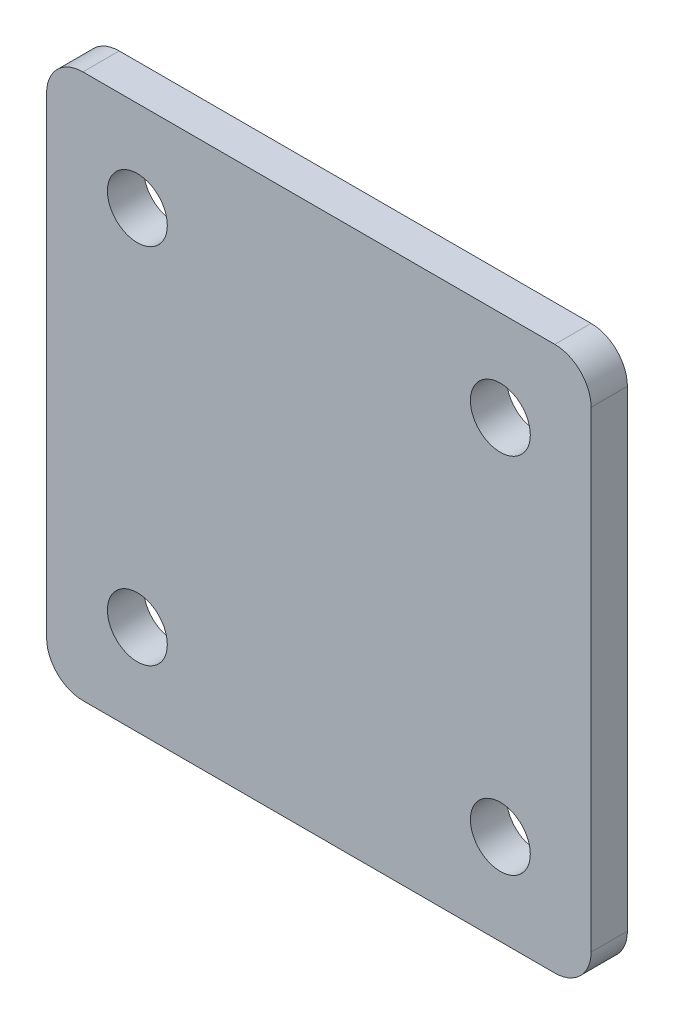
from build123d import *

# Parameters (mm, degrees)
SKETCH_1_W         = 30
SKETCH_1_H         = 30
EXTRUDE_1_DEPTH    = 2
HOLE_WIZARD_M4_1_D = 3.3
FILLET_1_R         = 2


with BuildPart() as part:
    # Sketch 1 → Extrude 1 (new body)
    with BuildSketch(Plane.XY):
        Rectangle(SKETCH_1_W, SKETCH_1_H)
    extrude(amount=EXTRUDE_1_DEPTH)

    # Hole Wizard M4 _1 (through all)
    with Locations(Plane.XY.offset(2)):
        with Locations((-10, 10), (10, 10), (-10, -10), (10, -10)):
            Hole(HOLE_WIZARD_M4_1_D / 2)

    # Fillet 1
    fillet_1_edges = [part.edges().sort_by_distance(p)[0] for p in [
        (15, -15, 1),
        (-15, -15, 1),
        (-15, 15, 1),
        (15, 15, 1),
    ]]
    fillet(fillet_1_edges, radius=FILLET_1_R)


solid = part.part
